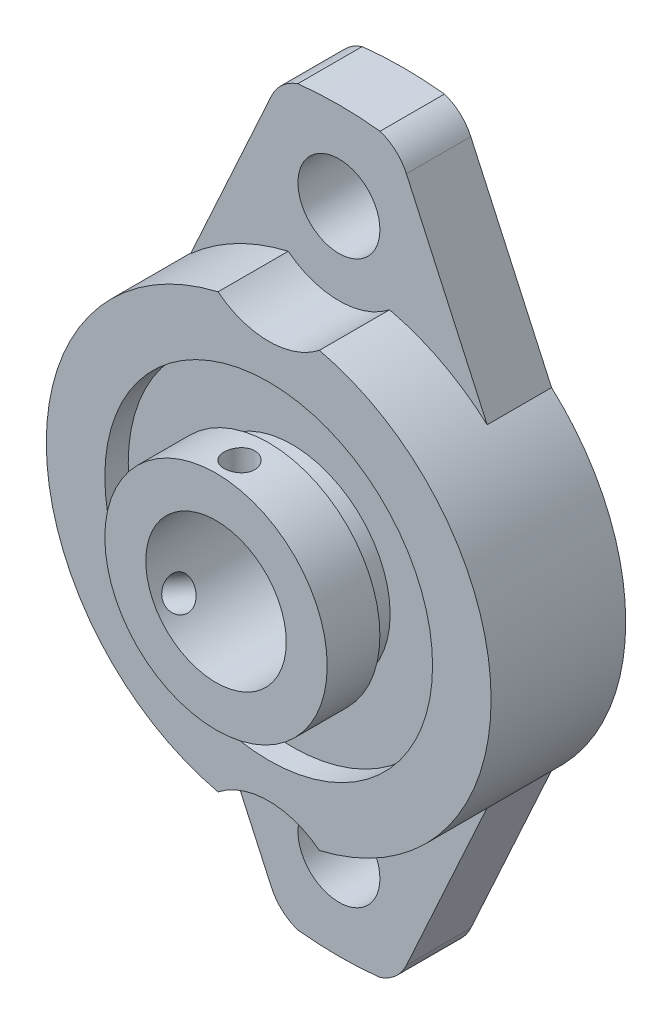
from build123d import *
from build123d.topology import SkipClean

# Parameters (mm, degrees)
SKETCH2_R           = 14
SKETCH2_R_2         = 3.5
BOSS_EXTRUDE1_DEPTH = 5.5
SKETCH3_R           = 7
CUT_EXTRUDE1_DEPTH  = 39.255719
TAP1_REACH          = 49.937
TAP1_BORE_R         = 1.3105
CIRPATTERN1_COUNT   = 2
CIRPATTERN1_ANGLE   = 120


with BuildPart() as part:
    # Sketch1 → Revolve1 (revolve)
    with BuildSketch(Plane(origin=(0, 0, 0), x_dir=(0, 0, -1), z_dir=(1, 0, 0)), mode=Mode.PRIVATE) as revolve1_sk:
        with BuildLine():
            Line((-11.5, 19), (0, 19))
            Line((0, 19), (0, 14))
            Line((0, 14), (-1.5, 14))
            Line((-1.5, 14), (-1.5, 8.425))
            ThreePointArc((-1.5, 8.425), (-1.55, 8.375), (-1.5, 8.325))
            Line((-1.5, 8.325), (-1.5, 6))
            Line((-1.5, 6), (-16, 6))
            Line((-16, 6), (-16, 9.5))
            Line((-16, 9.5), (-11.5, 9.5))
            Line((-11.5, 9.5), (-11.5, 8.375))
            Line((-11.5, 8.375), (-9.5, 8.375))
            Line((-9.5, 8.375), (-9.5, 14))
            Line((-9.5, 14), (-11.5, 14))
            Line((-11.5, 14), (-11.5, 19))
        make_face()
    revolve(revolve1_sk.sketch.rotate(Axis((0, 0, 16), (0, 0, -1)), 90), axis=Axis((0, 0, 16), (0, 0, -1)))

    # Sketch2 → Boss-Extrude1 (add)
    with SkipClean():  # the faces are left unmerged after this step: merging them gives an invalid solid
        with BuildSketch(Plane.XY):
            with BuildLine():
                Line((-5.76484, 29.278248), (-12.6665, 14.161913))
                ThreePointArc((-12.6665, 14.161913), (-19, 0), (-12.6665, -14.161913))
                Line((-12.6665, -14.161913), (-5.76484, -29.278248))
                ThreePointArc((-5.76484, -29.278248), (-4.850203, -30.524474), (-3.514877, -31.303285))
                ThreePointArc((-3.514877, -31.303285), (0, -31.5), (3.514877, -31.303285))
                ThreePointArc((3.514877, -31.303285), (4.850203, -30.524474), (5.76484, -29.278248))
                Line((5.76484, -29.278248), (12.6665, -14.161913))
                ThreePointArc((12.6665, -14.161913), (19, 0), (12.6665, 14.161913))
                Line((12.6665, 14.161913), (5.76484, 29.278248))
                ThreePointArc((5.76484, 29.278248), (4.850203, 30.524474), (3.514877, 31.303285))
                ThreePointArc((3.514877, 31.303285), (0, 31.5), (-3.514877, 31.303285))
                ThreePointArc((-3.514877, 31.303285), (-4.850203, 30.524474), (-5.76484, 29.278248))
            make_face()
            Circle(SKETCH2_R, mode=Mode.SUBTRACT)
            with Locations((0, 24)):
                Circle(SKETCH2_R_2, mode=Mode.SUBTRACT)
            with Locations((0, -24)):
                Circle(SKETCH2_R_2, mode=Mode.SUBTRACT)
        extrude(amount=BOSS_EXTRUDE1_DEPTH)

    # Sketch3 → Cut-Extrude1 (cut, through all)
    with SkipClean():  # the faces are left unmerged after this step: merging them gives an invalid solid
        with BuildSketch(Plane.XY.offset(5.5)):
            with Locations((0, 24)):
                Circle(SKETCH3_R)
            with Locations((0, -24)):
                Circle(SKETCH3_R)
        extrude(amount=CUT_EXTRUDE1_DEPTH, mode=Mode.SUBTRACT)

    # Tap1 bore → Tap1 (cut, up to next)
    with BuildSketch(Plane(origin=(0, 9.5, 0), x_dir=(1, 0, 0), z_dir=(0, 1, 0)), mode=Mode.PRIVATE) as tap1_sk1:
        with Locations((0, -14)):
            Circle(TAP1_BORE_R)
    tap1_tool1 = extrude(tap1_sk1.sketch, amount=-TAP1_REACH, mode=Mode.PRIVATE) & part.part
    tap1 = tap1_tool1.solids().sort_by_distance((0, 9.5, 14))[0]
    add(tap1, mode=Mode.SUBTRACT)

    # CirPattern1: Tap1 ×2 about axis
    with SkipClean():  # the faces are left unmerged after this step: merging them gives an invalid solid
        cirpattern1_axis = Axis((0, 0, 16), (0, 0, 1))
        for i in range(1, CIRPATTERN1_COUNT):
            add(tap1.rotate(cirpattern1_axis, i * CIRPATTERN1_ANGLE / (CIRPATTERN1_COUNT - 1)), mode=Mode.SUBTRACT)


solid = part.part
